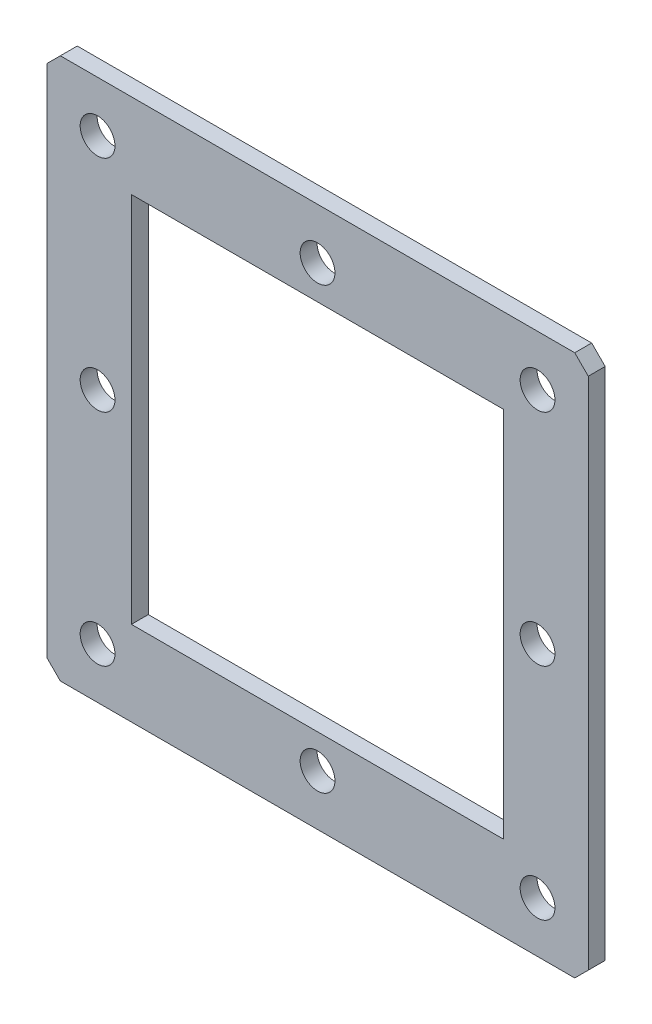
ISO-10303-21;
HEADER;
FILE_DESCRIPTION(('STEP AP214'),'2;1');
FILE_NAME('part.step','',(''),(''),'','','');
FILE_SCHEMA(('AUTOMOTIVE_DESIGN { 1 0 10303 214 1 1 1 1 }'));
ENDSEC;
DATA;
#1=APPLICATION_CONTEXT('core data for automotive mechanical design processes');
#2=APPLICATION_PROTOCOL_DEFINITION('international standard','automotive_design',2000,#1);
#3=PRODUCT_CONTEXT('',#1,'mechanical');
#4=PRODUCT('Part','Part','',(#3));
#5=PRODUCT_RELATED_PRODUCT_CATEGORY('part','',(#4));
#6=PRODUCT_DEFINITION_FORMATION('','',#4);
#7=PRODUCT_DEFINITION_CONTEXT('part definition',#1,'design');
#8=PRODUCT_DEFINITION('design','',#6,#7);
#9=PRODUCT_DEFINITION_SHAPE('','',#8);
#10=(LENGTH_UNIT() NAMED_UNIT(*) SI_UNIT(.MILLI.,.METRE.));
#11=(NAMED_UNIT(*) PLANE_ANGLE_UNIT() SI_UNIT($,.RADIAN.));
#12=(NAMED_UNIT(*) SI_UNIT($,.STERADIAN.) SOLID_ANGLE_UNIT());
#13=UNCERTAINTY_MEASURE_WITH_UNIT(LENGTH_MEASURE(1.E-05),#10,'distance_accuracy_value','');
#14=(GEOMETRIC_REPRESENTATION_CONTEXT(3) GLOBAL_UNCERTAINTY_ASSIGNED_CONTEXT((#13)) GLOBAL_UNIT_ASSIGNED_CONTEXT((#10,
#11,#12)) REPRESENTATION_CONTEXT('',''));
#15=CARTESIAN_POINT('',(0.,0.,0.));
#16=DIRECTION('',(0.,0.,1.));
#17=DIRECTION('',(1.,0.,0.));
#18=AXIS2_PLACEMENT_3D('',#15,#16,#17);
#19=CARTESIAN_POINT('',(-50.4258223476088,0.,3.175));
#20=DIRECTION('',(-1.,0.,0.));
#21=DIRECTION('',(0.,0.,1.));
#22=AXIS2_PLACEMENT_3D('',#19,#20,#21);
#23=PLANE('',#22);
#24=DIRECTION('',(0.,1.,0.));
#25=VECTOR('',#24,1.);
#26=CARTESIAN_POINT('',(-50.4258223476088,0.,0.));
#27=LINE('',#26,#25);
#28=CARTESIAN_POINT('',(-50.4258223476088,-47.636370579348,0.));
#29=VERTEX_POINT('',#28);
#30=CARTESIAN_POINT('',(-50.4258223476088,48.883629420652,0.));
#31=VERTEX_POINT('',#30);
#32=EDGE_CURVE('E270',#29,#31,#27,.T.);
#33=ORIENTED_EDGE('',*,*,#32,.F.);
#34=DIRECTION('',(0.,0.,-1.));
#35=VECTOR('',#34,1.);
#36=CARTESIAN_POINT('',(-50.4258223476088,-47.636370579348,3.175));
#37=LINE('',#36,#35);
#38=CARTESIAN_POINT('',(-50.4258223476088,-47.636370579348,3.175));
#39=VERTEX_POINT('',#38);
#40=EDGE_CURVE('E12',#39,#29,#37,.T.);
#41=ORIENTED_EDGE('',*,*,#40,.F.);
#42=DIRECTION('',(0.,1.,0.));
#43=VECTOR('',#42,1.);
#44=CARTESIAN_POINT('',(-50.4258223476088,0.,3.175));
#45=LINE('',#44,#43);
#46=CARTESIAN_POINT('',(-50.4258223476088,48.883629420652,3.175));
#47=VERTEX_POINT('',#46);
#48=EDGE_CURVE('E223',#39,#47,#45,.T.);
#49=ORIENTED_EDGE('',*,*,#48,.T.);
#50=DIRECTION('',(0.,0.,-1.));
#51=VECTOR('',#50,1.);
#52=CARTESIAN_POINT('',(-50.4258223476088,48.883629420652,3.175));
#53=LINE('',#52,#51);
#54=EDGE_CURVE('E246',#47,#31,#53,.T.);
#55=ORIENTED_EDGE('',*,*,#54,.T.);
#56=EDGE_LOOP('',(#33,#41,#49,#55));
#57=FACE_BOUND('',#56,.T.);
#58=ADVANCED_FACE('F75',(#57),#23,.T.);
#59=CARTESIAN_POINT('',(-49.0310964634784,-49.0310964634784,3.175));
#60=DIRECTION('',(0.707106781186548,0.707106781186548,0.));
#61=DIRECTION('',(-0.707106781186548,0.707106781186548,0.));
#62=AXIS2_PLACEMENT_3D('',#59,#60,#61);
#63=PLANE('',#62);
#64=DIRECTION('',(0.707106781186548,-0.707106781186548,0.));
#65=VECTOR('',#64,1.);
#66=CARTESIAN_POINT('',(-49.0310964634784,-49.0310964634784,0.));
#67=LINE('',#66,#65);
#68=CARTESIAN_POINT('',(-47.8858223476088,-50.176370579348,0.));
#69=VERTEX_POINT('',#68);
#70=EDGE_CURVE('E273',#29,#69,#67,.T.);
#71=ORIENTED_EDGE('',*,*,#70,.T.);
#72=DIRECTION('',(0.,0.,-1.));
#73=VECTOR('',#72,1.);
#74=CARTESIAN_POINT('',(-47.8858223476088,-50.176370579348,3.175));
#75=LINE('',#74,#73);
#76=CARTESIAN_POINT('',(-47.8858223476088,-50.176370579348,3.175));
#77=VERTEX_POINT('',#76);
#78=EDGE_CURVE('E83',#77,#69,#75,.T.);
#79=ORIENTED_EDGE('',*,*,#78,.F.);
#80=DIRECTION('',(0.707106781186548,-0.707106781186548,0.));
#81=VECTOR('',#80,1.);
#82=CARTESIAN_POINT('',(-49.0310964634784,-49.0310964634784,3.175));
#83=LINE('',#82,#81);
#84=EDGE_CURVE('E226',#39,#77,#83,.T.);
#85=ORIENTED_EDGE('',*,*,#84,.F.);
#86=ORIENTED_EDGE('',*,*,#40,.T.);
#87=EDGE_LOOP('',(#71,#79,#85,#86));
#88=FACE_BOUND('',#87,.T.);
#89=ADVANCED_FACE('F313',(#88),#63,.F.);
#90=CARTESIAN_POINT('',(0.,-50.176370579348,3.175));
#91=DIRECTION('',(0.,1.,0.));
#92=DIRECTION('',(0.,0.,1.));
#93=AXIS2_PLACEMENT_3D('',#90,#91,#92);
#94=PLANE('',#93);
#95=DIRECTION('',(1.,0.,0.));
#96=VECTOR('',#95,1.);
#97=CARTESIAN_POINT('',(0.,-50.176370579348,0.));
#98=LINE('',#97,#96);
#99=CARTESIAN_POINT('',(48.6341776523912,-50.176370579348,0.));
#100=VERTEX_POINT('',#99);
#101=EDGE_CURVE('E276',#69,#100,#98,.T.);
#102=ORIENTED_EDGE('',*,*,#101,.T.);
#103=DIRECTION('',(0.,0.,-1.));
#104=VECTOR('',#103,1.);
#105=CARTESIAN_POINT('',(48.6341776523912,-50.176370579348,3.175));
#106=LINE('',#105,#104);
#107=CARTESIAN_POINT('',(48.6341776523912,-50.176370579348,3.175));
#108=VERTEX_POINT('',#107);
#109=EDGE_CURVE('E303',#108,#100,#106,.T.);
#110=ORIENTED_EDGE('',*,*,#109,.F.);
#111=DIRECTION('',(1.,0.,0.));
#112=VECTOR('',#111,1.);
#113=CARTESIAN_POINT('',(0.,-50.176370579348,3.175));
#114=LINE('',#113,#112);
#115=EDGE_CURVE('E229',#77,#108,#114,.T.);
#116=ORIENTED_EDGE('',*,*,#115,.F.);
#117=ORIENTED_EDGE('',*,*,#78,.T.);
#118=EDGE_LOOP('',(#102,#110,#116,#117));
#119=FACE_BOUND('',#118,.T.);
#120=ADVANCED_FACE('F308',(#119),#94,.F.);
#121=CARTESIAN_POINT('',(49.4052741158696,-49.4052741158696,3.175));
#122=DIRECTION('',(-0.707106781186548,0.707106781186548,0.));
#123=DIRECTION('',(-0.707106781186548,-0.707106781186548,0.));
#124=AXIS2_PLACEMENT_3D('',#121,#122,#123);
#125=PLANE('',#124);
#126=DIRECTION('',(0.707106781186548,0.707106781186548,0.));
#127=VECTOR('',#126,1.);
#128=CARTESIAN_POINT('',(49.4052741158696,-49.4052741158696,0.));
#129=LINE('',#128,#127);
#130=CARTESIAN_POINT('',(51.1741776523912,-47.636370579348,0.));
#131=VERTEX_POINT('',#130);
#132=EDGE_CURVE('E279',#100,#131,#129,.T.);
#133=ORIENTED_EDGE('',*,*,#132,.T.);
#134=DIRECTION('',(0.,0.,-1.));
#135=VECTOR('',#134,1.);
#136=CARTESIAN_POINT('',(51.1741776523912,-47.636370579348,3.175));
#137=LINE('',#136,#135);
#138=CARTESIAN_POINT('',(51.1741776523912,-47.636370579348,3.175));
#139=VERTEX_POINT('',#138);
#140=EDGE_CURVE('E300',#139,#131,#137,.T.);
#141=ORIENTED_EDGE('',*,*,#140,.F.);
#142=DIRECTION('',(0.707106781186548,0.707106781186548,0.));
#143=VECTOR('',#142,1.);
#144=CARTESIAN_POINT('',(49.4052741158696,-49.4052741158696,3.175));
#145=LINE('',#144,#143);
#146=EDGE_CURVE('E232',#108,#139,#145,.T.);
#147=ORIENTED_EDGE('',*,*,#146,.F.);
#148=ORIENTED_EDGE('',*,*,#109,.T.);
#149=EDGE_LOOP('',(#133,#141,#147,#148));
#150=FACE_BOUND('',#149,.T.);
#151=ADVANCED_FACE('F336',(#150),#125,.F.);
#152=CARTESIAN_POINT('',(51.1741776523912,0.,3.175));
#153=DIRECTION('',(-1.,0.,0.));
#154=DIRECTION('',(0.,0.,1.));
#155=AXIS2_PLACEMENT_3D('',#152,#153,#154);
#156=PLANE('',#155);
#157=DIRECTION('',(0.,1.,0.));
#158=VECTOR('',#157,1.);
#159=CARTESIAN_POINT('',(51.1741776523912,0.,0.));
#160=LINE('',#159,#158);
#161=CARTESIAN_POINT('',(51.1741776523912,48.883629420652,0.));
#162=VERTEX_POINT('',#161);
#163=EDGE_CURVE('E282',#131,#162,#160,.T.);
#164=ORIENTED_EDGE('',*,*,#163,.T.);
#165=DIRECTION('',(0.,0.,-1.));
#166=VECTOR('',#165,1.);
#167=CARTESIAN_POINT('',(51.1741776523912,48.883629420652,3.175));
#168=LINE('',#167,#166);
#169=CARTESIAN_POINT('',(51.1741776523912,48.883629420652,3.175));
#170=VERTEX_POINT('',#169);
#171=EDGE_CURVE('E298',#170,#162,#168,.T.);
#172=ORIENTED_EDGE('',*,*,#171,.F.);
#173=DIRECTION('',(0.,1.,0.));
#174=VECTOR('',#173,1.);
#175=CARTESIAN_POINT('',(51.1741776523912,0.,3.175));
#176=LINE('',#175,#174);
#177=EDGE_CURVE('E235',#139,#170,#176,.T.);
#178=ORIENTED_EDGE('',*,*,#177,.F.);
#179=ORIENTED_EDGE('',*,*,#140,.T.);
#180=EDGE_LOOP('',(#164,#172,#178,#179));
#181=FACE_BOUND('',#180,.T.);
#182=ADVANCED_FACE('F333',(#181),#156,.F.);
#183=CARTESIAN_POINT('',(50.0289035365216,50.0289035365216,3.175));
#184=DIRECTION('',(0.707106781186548,0.707106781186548,0.));
#185=DIRECTION('',(-0.707106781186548,0.707106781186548,0.));
#186=AXIS2_PLACEMENT_3D('',#183,#184,#185);
#187=PLANE('',#186);
#188=DIRECTION('',(0.707106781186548,-0.707106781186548,0.));
#189=VECTOR('',#188,1.);
#190=CARTESIAN_POINT('',(50.0289035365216,50.0289035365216,0.));
#191=LINE('',#190,#189);
#192=CARTESIAN_POINT('',(48.6341776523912,51.423629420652,0.));
#193=VERTEX_POINT('',#192);
#194=EDGE_CURVE('E285',#193,#162,#191,.T.);
#195=ORIENTED_EDGE('',*,*,#194,.F.);
#196=DIRECTION('',(0.,0.,-1.));
#197=VECTOR('',#196,1.);
#198=CARTESIAN_POINT('',(48.6341776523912,51.423629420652,3.175));
#199=LINE('',#198,#197);
#200=CARTESIAN_POINT('',(48.6341776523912,51.423629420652,3.175));
#201=VERTEX_POINT('',#200);
#202=EDGE_CURVE('E296',#201,#193,#199,.T.);
#203=ORIENTED_EDGE('',*,*,#202,.F.);
#204=DIRECTION('',(0.707106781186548,-0.707106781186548,0.));
#205=VECTOR('',#204,1.);
#206=CARTESIAN_POINT('',(50.0289035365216,50.0289035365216,3.175));
#207=LINE('',#206,#205);
#208=EDGE_CURVE('E237',#201,#170,#207,.T.);
#209=ORIENTED_EDGE('',*,*,#208,.T.);
#210=ORIENTED_EDGE('',*,*,#171,.T.);
#211=EDGE_LOOP('',(#195,#203,#209,#210));
#212=FACE_BOUND('',#211,.T.);
#213=ADVANCED_FACE('F330',(#212),#187,.T.);
#214=CARTESIAN_POINT('',(0.,51.423629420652,3.175));
#215=DIRECTION('',(0.,1.,0.));
#216=DIRECTION('',(0.,0.,1.));
#217=AXIS2_PLACEMENT_3D('',#214,#215,#216);
#218=PLANE('',#217);
#219=DIRECTION('',(1.,0.,0.));
#220=VECTOR('',#219,1.);
#221=CARTESIAN_POINT('',(0.,51.423629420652,0.));
#222=LINE('',#221,#220);
#223=CARTESIAN_POINT('',(-47.8858223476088,51.423629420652,0.));
#224=VERTEX_POINT('',#223);
#225=EDGE_CURVE('E288',#224,#193,#222,.T.);
#226=ORIENTED_EDGE('',*,*,#225,.F.);
#227=DIRECTION('',(0.,0.,-1.));
#228=VECTOR('',#227,1.);
#229=CARTESIAN_POINT('',(-47.8858223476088,51.423629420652,3.175));
#230=LINE('',#229,#228);
#231=CARTESIAN_POINT('',(-47.8858223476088,51.423629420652,3.175));
#232=VERTEX_POINT('',#231);
#233=EDGE_CURVE('E294',#232,#224,#230,.T.);
#234=ORIENTED_EDGE('',*,*,#233,.F.);
#235=DIRECTION('',(1.,0.,0.));
#236=VECTOR('',#235,1.);
#237=CARTESIAN_POINT('',(0.,51.423629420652,3.175));
#238=LINE('',#237,#236);
#239=EDGE_CURVE('E240',#232,#201,#238,.T.);
#240=ORIENTED_EDGE('',*,*,#239,.T.);
#241=ORIENTED_EDGE('',*,*,#202,.T.);
#242=EDGE_LOOP('',(#226,#234,#240,#241));
#243=FACE_BOUND('',#242,.T.);
#244=ADVANCED_FACE('F326',(#243),#218,.T.);
#245=CARTESIAN_POINT('',(-40.9008223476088,41.898629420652,3.175));
#246=DIRECTION('',(0.,0.,-1.));
#247=DIRECTION('',(-1.,0.,0.));
#248=AXIS2_PLACEMENT_3D('',#245,#246,#247);
#249=CYLINDRICAL_SURFACE('',#248,3.2639);
#250=CARTESIAN_POINT('',(-40.9008223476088,41.898629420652,3.175));
#251=DIRECTION('',(0.,0.,1.));
#252=DIRECTION('',(1.,0.,0.));
#253=AXIS2_PLACEMENT_3D('',#250,#251,#252);
#254=CIRCLE('',#253,3.2639);
#255=CARTESIAN_POINT('',(-37.6369223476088,41.898629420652,3.175));
#256=VERTEX_POINT('',#255);
#257=EDGE_CURVE('E220',#256,#256,#254,.T.);
#258=ORIENTED_EDGE('',*,*,#257,.T.);
#259=EDGE_LOOP('',(#258));
#260=FACE_BOUND('',#259,.T.);
#261=CARTESIAN_POINT('',(-40.9008223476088,41.898629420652,0.));
#262=DIRECTION('',(0.,0.,1.));
#263=DIRECTION('',(1.,0.,0.));
#264=AXIS2_PLACEMENT_3D('',#261,#262,#263);
#265=CIRCLE('',#264,3.2639);
#266=CARTESIAN_POINT('',(-37.6369223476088,41.898629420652,0.));
#267=VERTEX_POINT('',#266);
#268=EDGE_CURVE('E267',#267,#267,#265,.T.);
#269=ORIENTED_EDGE('',*,*,#268,.F.);
#270=EDGE_LOOP('',(#269));
#271=FACE_BOUND('',#270,.T.);
#272=ADVANCED_FACE('F356',(#260,#271),#249,.F.);
#273=CARTESIAN_POINT('',(41.6491776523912,41.898629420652,3.175));
#274=DIRECTION('',(0.,0.,-1.));
#275=DIRECTION('',(-1.,0.,0.));
#276=AXIS2_PLACEMENT_3D('',#273,#274,#275);
#277=CYLINDRICAL_SURFACE('',#276,3.2639);
#278=CARTESIAN_POINT('',(41.6491776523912,41.898629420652,3.175));
#279=DIRECTION('',(0.,0.,1.));
#280=DIRECTION('',(1.,0.,0.));
#281=AXIS2_PLACEMENT_3D('',#278,#279,#280);
#282=CIRCLE('',#281,3.2639);
#283=CARTESIAN_POINT('',(44.9130776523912,41.898629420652,3.175));
#284=VERTEX_POINT('',#283);
#285=EDGE_CURVE('E217',#284,#284,#282,.T.);
#286=ORIENTED_EDGE('',*,*,#285,.T.);
#287=EDGE_LOOP('',(#286));
#288=FACE_BOUND('',#287,.T.);
#289=CARTESIAN_POINT('',(41.6491776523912,41.898629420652,0.));
#290=DIRECTION('',(0.,0.,1.));
#291=DIRECTION('',(1.,0.,0.));
#292=AXIS2_PLACEMENT_3D('',#289,#290,#291);
#293=CIRCLE('',#292,3.2639);
#294=CARTESIAN_POINT('',(44.9130776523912,41.898629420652,0.));
#295=VERTEX_POINT('',#294);
#296=EDGE_CURVE('E264',#295,#295,#293,.T.);
#297=ORIENTED_EDGE('',*,*,#296,.F.);
#298=EDGE_LOOP('',(#297));
#299=FACE_BOUND('',#298,.T.);
#300=ADVANCED_FACE('F359',(#288,#299),#277,.F.);
#301=CARTESIAN_POINT('',(41.6491776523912,0.623629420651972,3.175));
#302=DIRECTION('',(0.,0.,-1.));
#303=DIRECTION('',(-1.,0.,0.));
#304=AXIS2_PLACEMENT_3D('',#301,#302,#303);
#305=CYLINDRICAL_SURFACE('',#304,3.2639);
#306=CARTESIAN_POINT('',(41.6491776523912,0.623629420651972,3.175));
#307=DIRECTION('',(0.,0.,1.));
#308=DIRECTION('',(1.,0.,0.));
#309=AXIS2_PLACEMENT_3D('',#306,#307,#308);
#310=CIRCLE('',#309,3.2639);
#311=CARTESIAN_POINT('',(44.9130776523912,0.623629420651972,3.175));
#312=VERTEX_POINT('',#311);
#313=EDGE_CURVE('E214',#312,#312,#310,.T.);
#314=ORIENTED_EDGE('',*,*,#313,.T.);
#315=EDGE_LOOP('',(#314));
#316=FACE_BOUND('',#315,.T.);
#317=CARTESIAN_POINT('',(41.6491776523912,0.623629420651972,0.));
#318=DIRECTION('',(0.,0.,1.));
#319=DIRECTION('',(1.,0.,0.));
#320=AXIS2_PLACEMENT_3D('',#317,#318,#319);
#321=CIRCLE('',#320,3.2639);
#322=CARTESIAN_POINT('',(44.9130776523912,0.623629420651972,0.));
#323=VERTEX_POINT('',#322);
#324=EDGE_CURVE('E261',#323,#323,#321,.T.);
#325=ORIENTED_EDGE('',*,*,#324,.F.);
#326=EDGE_LOOP('',(#325));
#327=FACE_BOUND('',#326,.T.);
#328=ADVANCED_FACE('F363',(#316,#327),#305,.F.);
#329=CARTESIAN_POINT('',(41.6491776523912,-40.651370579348,3.175));
#330=DIRECTION('',(0.,0.,-1.));
#331=DIRECTION('',(-1.,0.,0.));
#332=AXIS2_PLACEMENT_3D('',#329,#330,#331);
#333=CYLINDRICAL_SURFACE('',#332,3.2639);
#334=CARTESIAN_POINT('',(41.6491776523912,-40.651370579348,3.175));
#335=DIRECTION('',(0.,0.,1.));
#336=DIRECTION('',(1.,0.,0.));
#337=AXIS2_PLACEMENT_3D('',#334,#335,#336);
#338=CIRCLE('',#337,3.2639);
#339=CARTESIAN_POINT('',(44.9130776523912,-40.651370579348,3.175));
#340=VERTEX_POINT('',#339);
#341=EDGE_CURVE('E211',#340,#340,#338,.T.);
#342=ORIENTED_EDGE('',*,*,#341,.T.);
#343=EDGE_LOOP('',(#342));
#344=FACE_BOUND('',#343,.T.);
#345=CARTESIAN_POINT('',(41.6491776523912,-40.651370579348,0.));
#346=DIRECTION('',(0.,0.,1.));
#347=DIRECTION('',(1.,0.,0.));
#348=AXIS2_PLACEMENT_3D('',#345,#346,#347);
#349=CIRCLE('',#348,3.2639);
#350=CARTESIAN_POINT('',(44.9130776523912,-40.651370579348,0.));
#351=VERTEX_POINT('',#350);
#352=EDGE_CURVE('E258',#351,#351,#349,.T.);
#353=ORIENTED_EDGE('',*,*,#352,.F.);
#354=EDGE_LOOP('',(#353));
#355=FACE_BOUND('',#354,.T.);
#356=ADVANCED_FACE('F367',(#344,#355),#333,.F.);
#357=CARTESIAN_POINT('',(-40.9008223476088,-40.651370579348,3.175));
#358=DIRECTION('',(0.,0.,-1.));
#359=DIRECTION('',(-1.,0.,0.));
#360=AXIS2_PLACEMENT_3D('',#357,#358,#359);
#361=CYLINDRICAL_SURFACE('',#360,3.2639);
#362=CARTESIAN_POINT('',(-40.9008223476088,-40.651370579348,3.175));
#363=DIRECTION('',(0.,0.,1.));
#364=DIRECTION('',(1.,0.,0.));
#365=AXIS2_PLACEMENT_3D('',#362,#363,#364);
#366=CIRCLE('',#365,3.2639);
#367=CARTESIAN_POINT('',(-37.6369223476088,-40.651370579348,3.175));
#368=VERTEX_POINT('',#367);
#369=EDGE_CURVE('E208',#368,#368,#366,.T.);
#370=ORIENTED_EDGE('',*,*,#369,.T.);
#371=EDGE_LOOP('',(#370));
#372=FACE_BOUND('',#371,.T.);
#373=CARTESIAN_POINT('',(-40.9008223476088,-40.651370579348,0.));
#374=DIRECTION('',(0.,0.,1.));
#375=DIRECTION('',(1.,0.,0.));
#376=AXIS2_PLACEMENT_3D('',#373,#374,#375);
#377=CIRCLE('',#376,3.2639);
#378=CARTESIAN_POINT('',(-37.6369223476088,-40.651370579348,0.));
#379=VERTEX_POINT('',#378);
#380=EDGE_CURVE('E255',#379,#379,#377,.T.);
#381=ORIENTED_EDGE('',*,*,#380,.F.);
#382=EDGE_LOOP('',(#381));
#383=FACE_BOUND('',#382,.T.);
#384=ADVANCED_FACE('F371',(#372,#383),#361,.F.);
#385=CARTESIAN_POINT('',(-40.9008223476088,0.623629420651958,3.175));
#386=DIRECTION('',(0.,0.,-1.));
#387=DIRECTION('',(-1.,0.,0.));
#388=AXIS2_PLACEMENT_3D('',#385,#386,#387);
#389=CYLINDRICAL_SURFACE('',#388,3.2639);
#390=CARTESIAN_POINT('',(-40.9008223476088,0.623629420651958,3.175));
#391=DIRECTION('',(0.,0.,1.));
#392=DIRECTION('',(1.,0.,0.));
#393=AXIS2_PLACEMENT_3D('',#390,#391,#392);
#394=CIRCLE('',#393,3.2639);
#395=CARTESIAN_POINT('',(-37.6369223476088,0.623629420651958,3.175));
#396=VERTEX_POINT('',#395);
#397=EDGE_CURVE('E205',#396,#396,#394,.T.);
#398=ORIENTED_EDGE('',*,*,#397,.T.);
#399=EDGE_LOOP('',(#398));
#400=FACE_BOUND('',#399,.T.);
#401=CARTESIAN_POINT('',(-40.9008223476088,0.623629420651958,0.));
#402=DIRECTION('',(0.,0.,1.));
#403=DIRECTION('',(1.,0.,0.));
#404=AXIS2_PLACEMENT_3D('',#401,#402,#403);
#405=CIRCLE('',#404,3.2639);
#406=CARTESIAN_POINT('',(-37.6369223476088,0.623629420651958,0.));
#407=VERTEX_POINT('',#406);
#408=EDGE_CURVE('E252',#407,#407,#405,.T.);
#409=ORIENTED_EDGE('',*,*,#408,.F.);
#410=EDGE_LOOP('',(#409));
#411=FACE_BOUND('',#410,.T.);
#412=ADVANCED_FACE('F375',(#400,#411),#389,.F.);
#413=CARTESIAN_POINT('',(0.374177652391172,41.898629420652,3.175));
#414=DIRECTION('',(0.,0.,-1.));
#415=DIRECTION('',(-1.,0.,0.));
#416=AXIS2_PLACEMENT_3D('',#413,#414,#415);
#417=CYLINDRICAL_SURFACE('',#416,3.2639);
#418=CARTESIAN_POINT('',(0.374177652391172,41.898629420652,3.175));
#419=DIRECTION('',(0.,0.,1.));
#420=DIRECTION('',(1.,0.,0.));
#421=AXIS2_PLACEMENT_3D('',#418,#419,#420);
#422=CIRCLE('',#421,3.2639);
#423=CARTESIAN_POINT('',(3.63807765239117,41.898629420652,3.175));
#424=VERTEX_POINT('',#423);
#425=EDGE_CURVE('E201',#424,#424,#422,.T.);
#426=ORIENTED_EDGE('',*,*,#425,.T.);
#427=EDGE_LOOP('',(#426));
#428=FACE_BOUND('',#427,.T.);
#429=CARTESIAN_POINT('',(0.374177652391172,41.898629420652,0.));
#430=DIRECTION('',(0.,0.,1.));
#431=DIRECTION('',(1.,0.,0.));
#432=AXIS2_PLACEMENT_3D('',#429,#430,#431);
#433=CIRCLE('',#432,3.2639);
#434=CARTESIAN_POINT('',(3.63807765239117,41.898629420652,0.));
#435=VERTEX_POINT('',#434);
#436=EDGE_CURVE('E249',#435,#435,#433,.T.);
#437=ORIENTED_EDGE('',*,*,#436,.F.);
#438=EDGE_LOOP('',(#437));
#439=FACE_BOUND('',#438,.T.);
#440=ADVANCED_FACE('F378',(#428,#439),#417,.F.);
#441=CARTESIAN_POINT('',(0.374177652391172,-40.651370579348,3.175));
#442=DIRECTION('',(0.,0.,-1.));
#443=DIRECTION('',(-1.,0.,0.));
#444=AXIS2_PLACEMENT_3D('',#441,#442,#443);
#445=CYLINDRICAL_SURFACE('',#444,3.2639);
#446=CARTESIAN_POINT('',(0.374177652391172,-40.651370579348,3.175));
#447=DIRECTION('',(0.,0.,1.));
#448=DIRECTION('',(1.,0.,0.));
#449=AXIS2_PLACEMENT_3D('',#446,#447,#448);
#450=CIRCLE('',#449,3.2639);
#451=CARTESIAN_POINT('',(3.63807765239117,-40.651370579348,3.175));
#452=VERTEX_POINT('',#451);
#453=EDGE_CURVE('E198',#452,#452,#450,.T.);
#454=ORIENTED_EDGE('',*,*,#453,.T.);
#455=EDGE_LOOP('',(#454));
#456=FACE_BOUND('',#455,.T.);
#457=CARTESIAN_POINT('',(0.374177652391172,-40.651370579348,0.));
#458=DIRECTION('',(0.,0.,1.));
#459=DIRECTION('',(1.,0.,0.));
#460=AXIS2_PLACEMENT_3D('',#457,#458,#459);
#461=CIRCLE('',#460,3.2639);
#462=CARTESIAN_POINT('',(3.63807765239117,-40.651370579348,0.));
#463=VERTEX_POINT('',#462);
#464=EDGE_CURVE('E194',#463,#463,#461,.T.);
#465=ORIENTED_EDGE('',*,*,#464,.F.);
#466=EDGE_LOOP('',(#465));
#467=FACE_BOUND('',#466,.T.);
#468=ADVANCED_FACE('F77',(#456,#467),#445,.F.);
#469=CARTESIAN_POINT('',(-49.6547258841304,49.6547258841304,3.175));
#470=DIRECTION('',(-0.707106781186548,0.707106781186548,0.));
#471=DIRECTION('',(-0.707106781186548,-0.707106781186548,0.));
#472=AXIS2_PLACEMENT_3D('',#469,#470,#471);
#473=PLANE('',#472);
#474=DIRECTION('',(0.707106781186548,0.707106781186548,0.));
#475=VECTOR('',#474,1.);
#476=CARTESIAN_POINT('',(-49.6547258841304,49.6547258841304,0.));
#477=LINE('',#476,#475);
#478=EDGE_CURVE('E202',#31,#224,#477,.T.);
#479=ORIENTED_EDGE('',*,*,#478,.F.);
#480=ORIENTED_EDGE('',*,*,#54,.F.);
#481=DIRECTION('',(0.707106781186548,0.707106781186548,0.));
#482=VECTOR('',#481,1.);
#483=CARTESIAN_POINT('',(-49.6547258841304,49.6547258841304,3.175));
#484=LINE('',#483,#482);
#485=EDGE_CURVE('E243',#47,#232,#484,.T.);
#486=ORIENTED_EDGE('',*,*,#485,.T.);
#487=ORIENTED_EDGE('',*,*,#233,.T.);
#488=EDGE_LOOP('',(#479,#480,#486,#487));
#489=FACE_BOUND('',#488,.T.);
#490=ADVANCED_FACE('F322',(#489),#473,.T.);
#491=CARTESIAN_POINT('',(0.,0.,3.175));
#492=DIRECTION('',(0.,0.,1.));
#493=DIRECTION('',(1.,0.,0.));
#494=AXIS2_PLACEMENT_3D('',#491,#492,#493);
#495=PLANE('',#494);
#496=DIRECTION('',(0.,1.,0.));
#497=VECTOR('',#496,1.);
#498=CARTESIAN_POINT('',(-34.5508223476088,-34.301370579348,3.175));
#499=LINE('',#498,#497);
#500=CARTESIAN_POINT('',(-34.5508223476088,-34.301370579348,3.175));
#501=VERTEX_POINT('',#500);
#502=CARTESIAN_POINT('',(-34.5508223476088,35.548629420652,3.175));
#503=VERTEX_POINT('',#502);
#504=EDGE_CURVE('E165',#501,#503,#499,.T.);
#505=ORIENTED_EDGE('',*,*,#504,.T.);
#506=DIRECTION('',(1.,0.,0.));
#507=VECTOR('',#506,1.);
#508=CARTESIAN_POINT('',(-34.5508223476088,35.548629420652,3.175));
#509=LINE('',#508,#507);
#510=CARTESIAN_POINT('',(35.2991776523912,35.548629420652,3.175));
#511=VERTEX_POINT('',#510);
#512=EDGE_CURVE('E171',#503,#511,#509,.T.);
#513=ORIENTED_EDGE('',*,*,#512,.T.);
#514=DIRECTION('',(0.,1.,0.));
#515=VECTOR('',#514,1.);
#516=CARTESIAN_POINT('',(35.2991776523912,-34.301370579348,3.175));
#517=LINE('',#516,#515);
#518=CARTESIAN_POINT('',(35.2991776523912,-34.301370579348,3.175));
#519=VERTEX_POINT('',#518);
#520=EDGE_CURVE('E175',#519,#511,#517,.T.);
#521=ORIENTED_EDGE('',*,*,#520,.F.);
#522=DIRECTION('',(1.,0.,0.));
#523=VECTOR('',#522,1.);
#524=CARTESIAN_POINT('',(-34.5508223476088,-34.301370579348,3.175));
#525=LINE('',#524,#523);
#526=EDGE_CURVE('E168',#501,#519,#525,.T.);
#527=ORIENTED_EDGE('',*,*,#526,.F.);
#528=EDGE_LOOP('',(#505,#513,#521,#527));
#529=FACE_BOUND('',#528,.T.);
#530=ORIENTED_EDGE('',*,*,#453,.F.);
#531=EDGE_LOOP('',(#530));
#532=FACE_BOUND('',#531,.T.);
#533=ORIENTED_EDGE('',*,*,#425,.F.);
#534=EDGE_LOOP('',(#533));
#535=FACE_BOUND('',#534,.T.);
#536=ORIENTED_EDGE('',*,*,#397,.F.);
#537=EDGE_LOOP('',(#536));
#538=FACE_BOUND('',#537,.T.);
#539=ORIENTED_EDGE('',*,*,#369,.F.);
#540=EDGE_LOOP('',(#539));
#541=FACE_BOUND('',#540,.T.);
#542=ORIENTED_EDGE('',*,*,#341,.F.);
#543=EDGE_LOOP('',(#542));
#544=FACE_BOUND('',#543,.T.);
#545=ORIENTED_EDGE('',*,*,#313,.F.);
#546=EDGE_LOOP('',(#545));
#547=FACE_BOUND('',#546,.T.);
#548=ORIENTED_EDGE('',*,*,#285,.F.);
#549=EDGE_LOOP('',(#548));
#550=FACE_BOUND('',#549,.T.);
#551=ORIENTED_EDGE('',*,*,#257,.F.);
#552=EDGE_LOOP('',(#551));
#553=FACE_BOUND('',#552,.T.);
#554=ORIENTED_EDGE('',*,*,#48,.F.);
#555=ORIENTED_EDGE('',*,*,#84,.T.);
#556=ORIENTED_EDGE('',*,*,#115,.T.);
#557=ORIENTED_EDGE('',*,*,#146,.T.);
#558=ORIENTED_EDGE('',*,*,#177,.T.);
#559=ORIENTED_EDGE('',*,*,#208,.F.);
#560=ORIENTED_EDGE('',*,*,#239,.F.);
#561=ORIENTED_EDGE('',*,*,#485,.F.);
#562=EDGE_LOOP('',(#554,#555,#556,#557,#558,#559,#560,#561));
#563=FACE_BOUND('',#562,.T.);
#564=ADVANCED_FACE('F177',(#529,#532,#535,#538,#541,#544,#547,#550,#553,#563),#495,.T.);
#565=CARTESIAN_POINT('',(0.,0.,0.));
#566=DIRECTION('',(0.,0.,1.));
#567=DIRECTION('',(1.,0.,0.));
#568=AXIS2_PLACEMENT_3D('',#565,#566,#567);
#569=PLANE('',#568);
#570=DIRECTION('',(1.,0.,0.));
#571=VECTOR('',#570,1.);
#572=CARTESIAN_POINT('',(-34.5508223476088,35.548629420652,0.));
#573=LINE('',#572,#571);
#574=CARTESIAN_POINT('',(-34.5508223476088,35.548629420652,0.));
#575=VERTEX_POINT('',#574);
#576=CARTESIAN_POINT('',(35.2991776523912,35.548629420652,0.));
#577=VERTEX_POINT('',#576);
#578=EDGE_CURVE('E188',#575,#577,#573,.T.);
#579=ORIENTED_EDGE('',*,*,#578,.F.);
#580=DIRECTION('',(0.,1.,0.));
#581=VECTOR('',#580,1.);
#582=CARTESIAN_POINT('',(-34.5508223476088,-34.301370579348,0.));
#583=LINE('',#582,#581);
#584=CARTESIAN_POINT('',(-34.5508223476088,-34.301370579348,0.));
#585=VERTEX_POINT('',#584);
#586=EDGE_CURVE('E98',#585,#575,#583,.T.);
#587=ORIENTED_EDGE('',*,*,#586,.F.);
#588=DIRECTION('',(1.,0.,0.));
#589=VECTOR('',#588,1.);
#590=CARTESIAN_POINT('',(-34.5508223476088,-34.301370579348,0.));
#591=LINE('',#590,#589);
#592=CARTESIAN_POINT('',(35.2991776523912,-34.301370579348,0.));
#593=VERTEX_POINT('',#592);
#594=EDGE_CURVE('E179',#585,#593,#591,.T.);
#595=ORIENTED_EDGE('',*,*,#594,.T.);
#596=DIRECTION('',(0.,1.,0.));
#597=VECTOR('',#596,1.);
#598=CARTESIAN_POINT('',(35.2991776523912,-34.301370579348,0.));
#599=LINE('',#598,#597);
#600=EDGE_CURVE('E182',#593,#577,#599,.T.);
#601=ORIENTED_EDGE('',*,*,#600,.T.);
#602=EDGE_LOOP('',(#579,#587,#595,#601));
#603=FACE_BOUND('',#602,.T.);
#604=ORIENTED_EDGE('',*,*,#464,.T.);
#605=EDGE_LOOP('',(#604));
#606=FACE_BOUND('',#605,.T.);
#607=ORIENTED_EDGE('',*,*,#436,.T.);
#608=EDGE_LOOP('',(#607));
#609=FACE_BOUND('',#608,.T.);
#610=ORIENTED_EDGE('',*,*,#408,.T.);
#611=EDGE_LOOP('',(#610));
#612=FACE_BOUND('',#611,.T.);
#613=ORIENTED_EDGE('',*,*,#380,.T.);
#614=EDGE_LOOP('',(#613));
#615=FACE_BOUND('',#614,.T.);
#616=ORIENTED_EDGE('',*,*,#352,.T.);
#617=EDGE_LOOP('',(#616));
#618=FACE_BOUND('',#617,.T.);
#619=ORIENTED_EDGE('',*,*,#324,.T.);
#620=EDGE_LOOP('',(#619));
#621=FACE_BOUND('',#620,.T.);
#622=ORIENTED_EDGE('',*,*,#296,.T.);
#623=EDGE_LOOP('',(#622));
#624=FACE_BOUND('',#623,.T.);
#625=ORIENTED_EDGE('',*,*,#268,.T.);
#626=EDGE_LOOP('',(#625));
#627=FACE_BOUND('',#626,.T.);
#628=ORIENTED_EDGE('',*,*,#32,.T.);
#629=ORIENTED_EDGE('',*,*,#478,.T.);
#630=ORIENTED_EDGE('',*,*,#225,.T.);
#631=ORIENTED_EDGE('',*,*,#194,.T.);
#632=ORIENTED_EDGE('',*,*,#163,.F.);
#633=ORIENTED_EDGE('',*,*,#132,.F.);
#634=ORIENTED_EDGE('',*,*,#101,.F.);
#635=ORIENTED_EDGE('',*,*,#70,.F.);
#636=EDGE_LOOP('',(#628,#629,#630,#631,#632,#633,#634,#635));
#637=FACE_BOUND('',#636,.T.);
#638=ADVANCED_FACE('F316',(#603,#606,#609,#612,#615,#618,#621,#624,#627,#637),#569,.F.);
#639=CARTESIAN_POINT('',(-34.5508223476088,-34.301370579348,3.175));
#640=DIRECTION('',(-1.,0.,0.));
#641=DIRECTION('',(0.,0.,1.));
#642=AXIS2_PLACEMENT_3D('',#639,#640,#641);
#643=PLANE('',#642);
#644=ORIENTED_EDGE('',*,*,#586,.T.);
#645=DIRECTION('',(0.,0.,-1.));
#646=VECTOR('',#645,1.);
#647=CARTESIAN_POINT('',(-34.5508223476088,35.548629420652,3.175));
#648=LINE('',#647,#646);
#649=EDGE_CURVE('E162',#503,#575,#648,.T.);
#650=ORIENTED_EDGE('',*,*,#649,.F.);
#651=ORIENTED_EDGE('',*,*,#504,.F.);
#652=DIRECTION('',(0.,0.,-1.));
#653=VECTOR('',#652,1.);
#654=CARTESIAN_POINT('',(-34.5508223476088,-34.301370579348,3.175));
#655=LINE('',#654,#653);
#656=EDGE_CURVE('E192',#501,#585,#655,.T.);
#657=ORIENTED_EDGE('',*,*,#656,.T.);
#658=EDGE_LOOP('',(#644,#650,#651,#657));
#659=FACE_BOUND('',#658,.T.);
#660=ADVANCED_FACE('F163',(#659),#643,.F.);
#661=CARTESIAN_POINT('',(-34.5508223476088,-34.301370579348,3.175));
#662=DIRECTION('',(0.,1.,0.));
#663=DIRECTION('',(0.,0.,1.));
#664=AXIS2_PLACEMENT_3D('',#661,#662,#663);
#665=PLANE('',#664);
#666=ORIENTED_EDGE('',*,*,#594,.F.);
#667=ORIENTED_EDGE('',*,*,#656,.F.);
#668=ORIENTED_EDGE('',*,*,#526,.T.);
#669=DIRECTION('',(0.,0.,-1.));
#670=VECTOR('',#669,1.);
#671=CARTESIAN_POINT('',(35.2991776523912,-34.301370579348,3.175));
#672=LINE('',#671,#670);
#673=EDGE_CURVE('E195',#519,#593,#672,.T.);
#674=ORIENTED_EDGE('',*,*,#673,.T.);
#675=EDGE_LOOP('',(#666,#667,#668,#674));
#676=FACE_BOUND('',#675,.T.);
#677=ADVANCED_FACE('F453',(#676),#665,.T.);
#678=CARTESIAN_POINT('',(35.2991776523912,-34.301370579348,3.175));
#679=DIRECTION('',(-1.,0.,0.));
#680=DIRECTION('',(0.,0.,1.));
#681=AXIS2_PLACEMENT_3D('',#678,#679,#680);
#682=PLANE('',#681);
#683=ORIENTED_EDGE('',*,*,#600,.F.);
#684=ORIENTED_EDGE('',*,*,#673,.F.);
#685=ORIENTED_EDGE('',*,*,#520,.T.);
#686=DIRECTION('',(0.,0.,-1.));
#687=VECTOR('',#686,1.);
#688=CARTESIAN_POINT('',(35.2991776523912,35.548629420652,3.175));
#689=LINE('',#688,#687);
#690=EDGE_CURVE('E90',#511,#577,#689,.T.);
#691=ORIENTED_EDGE('',*,*,#690,.T.);
#692=EDGE_LOOP('',(#683,#684,#685,#691));
#693=FACE_BOUND('',#692,.T.);
#694=ADVANCED_FACE('F462',(#693),#682,.T.);
#695=CARTESIAN_POINT('',(-34.5508223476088,35.548629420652,3.175));
#696=DIRECTION('',(0.,1.,0.));
#697=DIRECTION('',(0.,0.,1.));
#698=AXIS2_PLACEMENT_3D('',#695,#696,#697);
#699=PLANE('',#698);
#700=ORIENTED_EDGE('',*,*,#578,.T.);
#701=ORIENTED_EDGE('',*,*,#690,.F.);
#702=ORIENTED_EDGE('',*,*,#512,.F.);
#703=ORIENTED_EDGE('',*,*,#649,.T.);
#704=EDGE_LOOP('',(#700,#701,#702,#703));
#705=FACE_BOUND('',#704,.T.);
#706=ADVANCED_FACE('F172',(#705),#699,.F.);
#707=CLOSED_SHELL('',(#58,#89,#120,#151,#182,#213,#244,#272,#300,#328,#356,#384,#412,#440,#468,
#490,#564,#638,#660,#677,#694,#706));
#708=MANIFOLD_SOLID_BREP('B2',#707);
#709=ADVANCED_BREP_SHAPE_REPRESENTATION('',(#18,#708),#14);
#710=SHAPE_DEFINITION_REPRESENTATION(#9,#709);
ENDSEC;
END-ISO-10303-21;
